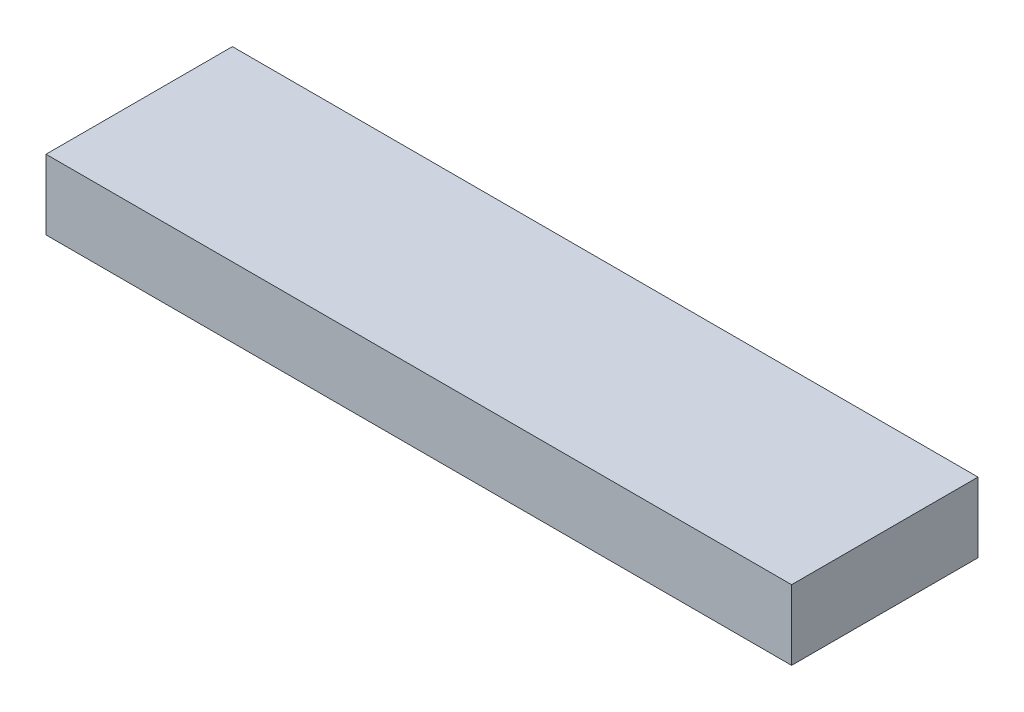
ISO-10303-21;
HEADER;
FILE_DESCRIPTION(('STEP AP214'),'2;1');
FILE_NAME('part.step','',(''),(''),'','','');
FILE_SCHEMA(('AUTOMOTIVE_DESIGN { 1 0 10303 214 1 1 1 1 }'));
ENDSEC;
DATA;
#1=APPLICATION_CONTEXT('core data for automotive mechanical design processes');
#2=APPLICATION_PROTOCOL_DEFINITION('international standard','automotive_design',2000,#1);
#3=PRODUCT_CONTEXT('',#1,'mechanical');
#4=PRODUCT('Part','Part','',(#3));
#5=PRODUCT_RELATED_PRODUCT_CATEGORY('part','',(#4));
#6=PRODUCT_DEFINITION_FORMATION('','',#4);
#7=PRODUCT_DEFINITION_CONTEXT('part definition',#1,'design');
#8=PRODUCT_DEFINITION('design','',#6,#7);
#9=PRODUCT_DEFINITION_SHAPE('','',#8);
#10=(LENGTH_UNIT() NAMED_UNIT(*) SI_UNIT(.MILLI.,.METRE.));
#11=(NAMED_UNIT(*) PLANE_ANGLE_UNIT() SI_UNIT($,.RADIAN.));
#12=(NAMED_UNIT(*) SI_UNIT($,.STERADIAN.) SOLID_ANGLE_UNIT());
#13=UNCERTAINTY_MEASURE_WITH_UNIT(LENGTH_MEASURE(1.E-05),#10,'distance_accuracy_value','');
#14=(GEOMETRIC_REPRESENTATION_CONTEXT(3) GLOBAL_UNCERTAINTY_ASSIGNED_CONTEXT((#13)) GLOBAL_UNIT_ASSIGNED_CONTEXT((#10,
#11,#12)) REPRESENTATION_CONTEXT('',''));
#15=CARTESIAN_POINT('',(0.,0.,0.));
#16=DIRECTION('',(0.,0.,1.));
#17=DIRECTION('',(1.,0.,0.));
#18=AXIS2_PLACEMENT_3D('',#15,#16,#17);
#19=CARTESIAN_POINT('',(160.,15.,20.));
#20=DIRECTION('',(0.,0.,-1.));
#21=DIRECTION('',(0.,1.,0.));
#22=AXIS2_PLACEMENT_3D('',#19,#20,#21);
#23=PLANE('',#22);
#24=DIRECTION('',(0.,-1.,0.));
#25=VECTOR('',#24,1.);
#26=CARTESIAN_POINT('',(0.,15.,20.));
#27=LINE('',#26,#25);
#28=CARTESIAN_POINT('',(0.,15.,20.));
#29=VERTEX_POINT('',#28);
#30=CARTESIAN_POINT('',(0.,0.,20.));
#31=VERTEX_POINT('',#30);
#32=EDGE_CURVE('E94',#29,#31,#27,.T.);
#33=ORIENTED_EDGE('',*,*,#32,.T.);
#34=DIRECTION('',(-1.,0.,0.));
#35=VECTOR('',#34,1.);
#36=CARTESIAN_POINT('',(160.,0.,20.));
#37=LINE('',#36,#35);
#38=CARTESIAN_POINT('',(160.,0.,20.));
#39=VERTEX_POINT('',#38);
#40=EDGE_CURVE('E11',#39,#31,#37,.T.);
#41=ORIENTED_EDGE('',*,*,#40,.F.);
#42=DIRECTION('',(0.,-1.,0.));
#43=VECTOR('',#42,1.);
#44=CARTESIAN_POINT('',(160.,15.,20.));
#45=LINE('',#44,#43);
#46=CARTESIAN_POINT('',(160.,15.,20.));
#47=VERTEX_POINT('',#46);
#48=EDGE_CURVE('E82',#47,#39,#45,.T.);
#49=ORIENTED_EDGE('',*,*,#48,.F.);
#50=DIRECTION('',(-1.,0.,0.));
#51=VECTOR('',#50,1.);
#52=CARTESIAN_POINT('',(160.,15.,20.));
#53=LINE('',#52,#51);
#54=EDGE_CURVE('E90',#47,#29,#53,.T.);
#55=ORIENTED_EDGE('',*,*,#54,.T.);
#56=EDGE_LOOP('',(#33,#41,#49,#55));
#57=FACE_BOUND('',#56,.T.);
#58=ADVANCED_FACE('F31',(#57),#23,.F.);
#59=CARTESIAN_POINT('',(160.,0.,20.));
#60=DIRECTION('',(0.,1.,0.));
#61=DIRECTION('',(0.,0.,1.));
#62=AXIS2_PLACEMENT_3D('',#59,#60,#61);
#63=PLANE('',#62);
#64=DIRECTION('',(0.,0.,-1.));
#65=VECTOR('',#64,1.);
#66=CARTESIAN_POINT('',(0.,0.,20.));
#67=LINE('',#66,#65);
#68=CARTESIAN_POINT('',(0.,0.,-20.));
#69=VERTEX_POINT('',#68);
#70=EDGE_CURVE('E86',#31,#69,#67,.T.);
#71=ORIENTED_EDGE('',*,*,#70,.T.);
#72=DIRECTION('',(-1.,0.,0.));
#73=VECTOR('',#72,1.);
#74=CARTESIAN_POINT('',(160.,0.,-20.));
#75=LINE('',#74,#73);
#76=CARTESIAN_POINT('',(160.,0.,-20.));
#77=VERTEX_POINT('',#76);
#78=EDGE_CURVE('E39',#77,#69,#75,.T.);
#79=ORIENTED_EDGE('',*,*,#78,.F.);
#80=DIRECTION('',(0.,0.,-1.));
#81=VECTOR('',#80,1.);
#82=CARTESIAN_POINT('',(160.,0.,20.));
#83=LINE('',#82,#81);
#84=EDGE_CURVE('E77',#39,#77,#83,.T.);
#85=ORIENTED_EDGE('',*,*,#84,.F.);
#86=ORIENTED_EDGE('',*,*,#40,.T.);
#87=EDGE_LOOP('',(#71,#79,#85,#86));
#88=FACE_BOUND('',#87,.T.);
#89=ADVANCED_FACE('F85',(#88),#63,.F.);
#90=CARTESIAN_POINT('',(160.,15.,-20.));
#91=DIRECTION('',(0.,0.,1.));
#92=DIRECTION('',(0.,-1.,0.));
#93=AXIS2_PLACEMENT_3D('',#90,#91,#92);
#94=PLANE('',#93);
#95=DIRECTION('',(0.,1.,0.));
#96=VECTOR('',#95,1.);
#97=CARTESIAN_POINT('',(0.,15.,-20.));
#98=LINE('',#97,#96);
#99=CARTESIAN_POINT('',(0.,15.,-20.));
#100=VERTEX_POINT('',#99);
#101=EDGE_CURVE('E64',#69,#100,#98,.T.);
#102=ORIENTED_EDGE('',*,*,#101,.T.);
#103=DIRECTION('',(-1.,0.,0.));
#104=VECTOR('',#103,1.);
#105=CARTESIAN_POINT('',(160.,15.,-20.));
#106=LINE('',#105,#104);
#107=CARTESIAN_POINT('',(160.,15.,-20.));
#108=VERTEX_POINT('',#107);
#109=EDGE_CURVE('E87',#108,#100,#106,.T.);
#110=ORIENTED_EDGE('',*,*,#109,.F.);
#111=DIRECTION('',(0.,1.,0.));
#112=VECTOR('',#111,1.);
#113=CARTESIAN_POINT('',(160.,15.,-20.));
#114=LINE('',#113,#112);
#115=EDGE_CURVE('E80',#77,#108,#114,.T.);
#116=ORIENTED_EDGE('',*,*,#115,.F.);
#117=ORIENTED_EDGE('',*,*,#78,.T.);
#118=EDGE_LOOP('',(#102,#110,#116,#117));
#119=FACE_BOUND('',#118,.T.);
#120=ADVANCED_FACE('F88',(#119),#94,.F.);
#121=CARTESIAN_POINT('',(160.,15.,20.));
#122=DIRECTION('',(0.,-1.,0.));
#123=DIRECTION('',(0.,0.,-1.));
#124=AXIS2_PLACEMENT_3D('',#121,#122,#123);
#125=PLANE('',#124);
#126=DIRECTION('',(0.,0.,1.));
#127=VECTOR('',#126,1.);
#128=CARTESIAN_POINT('',(0.,15.,20.));
#129=LINE('',#128,#127);
#130=EDGE_CURVE('E70',#100,#29,#129,.T.);
#131=ORIENTED_EDGE('',*,*,#130,.T.);
#132=ORIENTED_EDGE('',*,*,#54,.F.);
#133=DIRECTION('',(0.,0.,1.));
#134=VECTOR('',#133,1.);
#135=CARTESIAN_POINT('',(160.,15.,20.));
#136=LINE('',#135,#134);
#137=EDGE_CURVE('E47',#108,#47,#136,.T.);
#138=ORIENTED_EDGE('',*,*,#137,.F.);
#139=ORIENTED_EDGE('',*,*,#109,.T.);
#140=EDGE_LOOP('',(#131,#132,#138,#139));
#141=FACE_BOUND('',#140,.T.);
#142=ADVANCED_FACE('F101',(#141),#125,.F.);
#143=CARTESIAN_POINT('',(160.,0.,20.));
#144=DIRECTION('',(1.,0.,0.));
#145=DIRECTION('',(0.,0.,-1.));
#146=AXIS2_PLACEMENT_3D('',#143,#144,#145);
#147=PLANE('',#146);
#148=ORIENTED_EDGE('',*,*,#48,.T.);
#149=ORIENTED_EDGE('',*,*,#84,.T.);
#150=ORIENTED_EDGE('',*,*,#115,.T.);
#151=ORIENTED_EDGE('',*,*,#137,.T.);
#152=EDGE_LOOP('',(#148,#149,#150,#151));
#153=FACE_BOUND('',#152,.T.);
#154=ADVANCED_FACE('F78',(#153),#147,.T.);
#155=CARTESIAN_POINT('',(0.,0.,20.));
#156=DIRECTION('',(1.,0.,0.));
#157=DIRECTION('',(0.,0.,-1.));
#158=AXIS2_PLACEMENT_3D('',#155,#156,#157);
#159=PLANE('',#158);
#160=ORIENTED_EDGE('',*,*,#32,.F.);
#161=ORIENTED_EDGE('',*,*,#130,.F.);
#162=ORIENTED_EDGE('',*,*,#101,.F.);
#163=ORIENTED_EDGE('',*,*,#70,.F.);
#164=EDGE_LOOP('',(#160,#161,#162,#163));
#165=FACE_BOUND('',#164,.T.);
#166=ADVANCED_FACE('F104',(#165),#159,.F.);
#167=CLOSED_SHELL('',(#58,#89,#120,#142,#154,#166));
#168=MANIFOLD_SOLID_BREP('B2',#167);
#169=ADVANCED_BREP_SHAPE_REPRESENTATION('',(#18,#168),#14);
#170=SHAPE_DEFINITION_REPRESENTATION(#9,#169);
ENDSEC;
END-ISO-10303-21;
